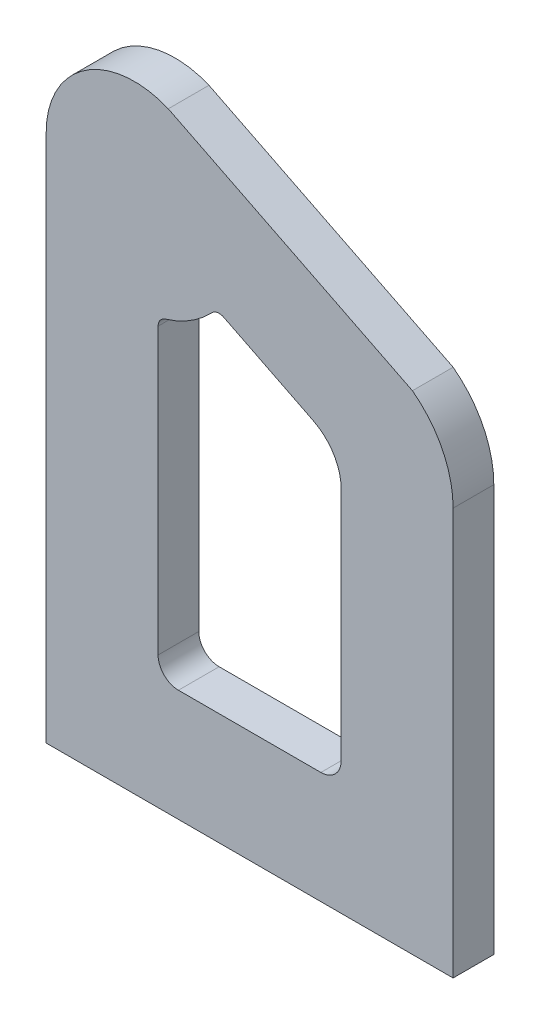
from build123d import *

# Parameters (mm, degrees)
BASE_EXTRUDE_DEPTH = 20
CUT_EXTRUDE2_DEPTH = 233.044057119


with BuildPart() as part:
    # Sketch1 → Base-Extrude (new body)
    with BuildSketch(Plane.XY):
        with BuildLine():
            Line((-90, -100), (110, -100))
            Line((110, -100), (110, 100))
            ThreePointArc((110, 100), (104.72135955, 122.360679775), (90, 140))
            Line((90, 140), (-30, 200))
            ThreePointArc((-30, 200), (-70.70367517, 196.055512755), (-90, 160))
            Line((-90, 160), (-90, -100))
        make_face()
    extrude(amount=BASE_EXTRUDE_DEPTH)

    # Sketch3 → Cut-Extrude2 (cut, through all)
    with BuildSketch(Plane(origin=(0, 0, 0), x_dir=(-1, 0, 0), z_dir=(0, 0, -1))):
        with BuildLine():
            Line((2.736269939, 124.876265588), (-41.180339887, 102.917960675))
            ThreePointArc((-41.180339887, 102.917960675), (-51.266270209, 93.700558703), (-55, 80.5572809))
            Line((-55, 80.5572809), (-55, -35))
            ThreePointArc((-55, -35), (-52.071067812, -42.071067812), (-45, -45))
            Line((-45, -45), (25, -45))
            ThreePointArc((25, -45), (32.071067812, -42.071067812), (35, -35))
            Line((35, -35), (35, 104.968443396))
            ThreePointArc((35, 104.968443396), (34.015369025, 107.947841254), (31.449275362, 109.753796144))
            ThreePointArc((31.449275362, 109.753796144), (19.107472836, 115.315093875), (8.597931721, 123.847248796))
            ThreePointArc((8.597931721, 123.847248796), (5.836869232, 125.328821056), (2.736269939, 124.876265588))
        make_face()
    extrude(amount=-CUT_EXTRUDE2_DEPTH, mode=Mode.SUBTRACT)


solid = part.part
